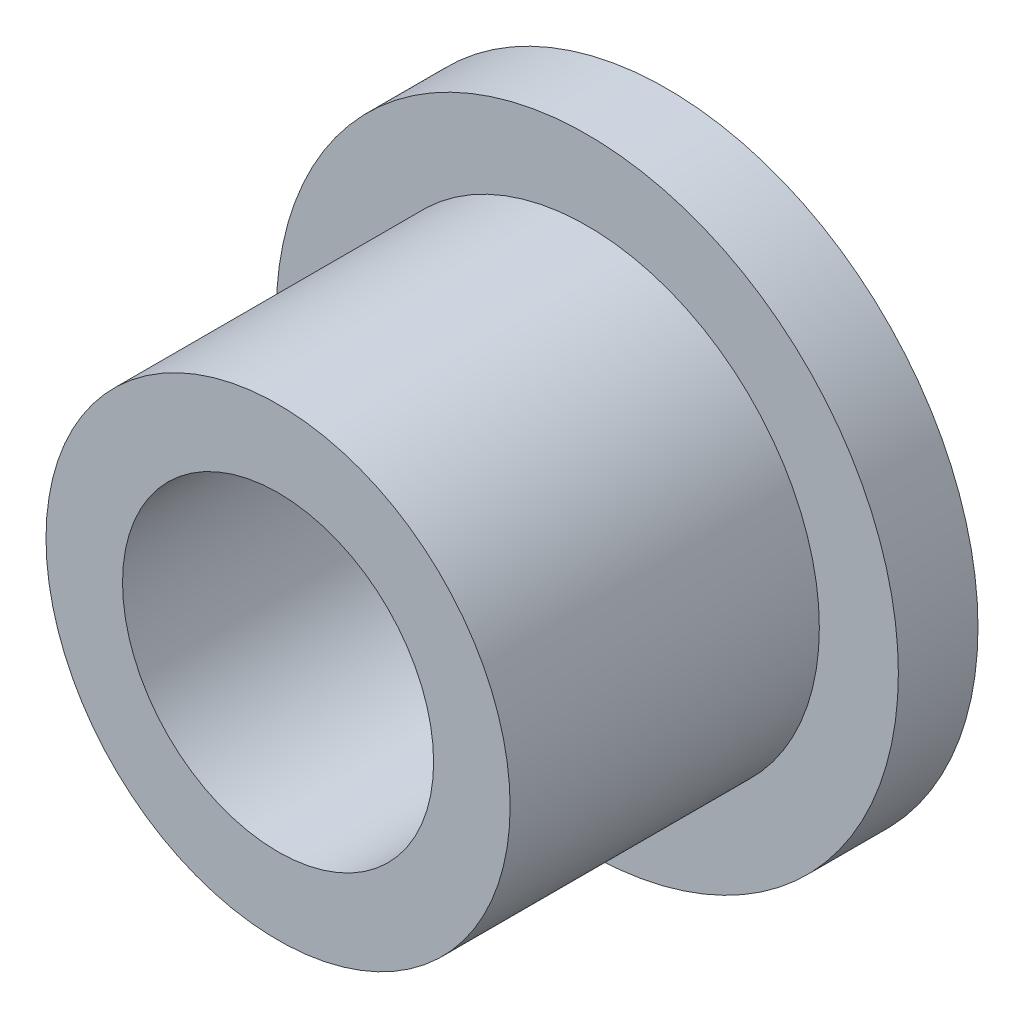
ISO-10303-21;
HEADER;
FILE_DESCRIPTION(('STEP AP214'),'2;1');
FILE_NAME('part.step','',(''),(''),'','','');
FILE_SCHEMA(('AUTOMOTIVE_DESIGN { 1 0 10303 214 1 1 1 1 }'));
ENDSEC;
DATA;
#1=APPLICATION_CONTEXT('core data for automotive mechanical design processes');
#2=APPLICATION_PROTOCOL_DEFINITION('international standard','automotive_design',2000,#1);
#3=PRODUCT_CONTEXT('',#1,'mechanical');
#4=PRODUCT('Part','Part','',(#3));
#5=PRODUCT_RELATED_PRODUCT_CATEGORY('part','',(#4));
#6=PRODUCT_DEFINITION_FORMATION('','',#4);
#7=PRODUCT_DEFINITION_CONTEXT('part definition',#1,'design');
#8=PRODUCT_DEFINITION('design','',#6,#7);
#9=PRODUCT_DEFINITION_SHAPE('','',#8);
#10=(LENGTH_UNIT() NAMED_UNIT(*) SI_UNIT(.MILLI.,.METRE.));
#11=(NAMED_UNIT(*) PLANE_ANGLE_UNIT() SI_UNIT($,.RADIAN.));
#12=(NAMED_UNIT(*) SI_UNIT($,.STERADIAN.) SOLID_ANGLE_UNIT());
#13=UNCERTAINTY_MEASURE_WITH_UNIT(LENGTH_MEASURE(1.E-05),#10,'distance_accuracy_value','');
#14=(GEOMETRIC_REPRESENTATION_CONTEXT(3) GLOBAL_UNCERTAINTY_ASSIGNED_CONTEXT((#13)) GLOBAL_UNIT_ASSIGNED_CONTEXT((#10,
#11,#12)) REPRESENTATION_CONTEXT('',''));
#15=CARTESIAN_POINT('',(0.,0.,0.));
#16=DIRECTION('',(0.,0.,1.));
#17=DIRECTION('',(1.,0.,0.));
#18=AXIS2_PLACEMENT_3D('',#15,#16,#17);
#19=CARTESIAN_POINT('',(0.,0.,7.9375));
#20=DIRECTION('',(0.,0.,-1.));
#21=DIRECTION('',(-1.,0.,0.));
#22=AXIS2_PLACEMENT_3D('',#19,#20,#21);
#23=CYLINDRICAL_SURFACE('',#22,4.7371);
#24=CARTESIAN_POINT('',(0.,0.,7.9375));
#25=DIRECTION('',(0.,0.,1.));
#26=DIRECTION('',(1.,0.,0.));
#27=AXIS2_PLACEMENT_3D('',#24,#25,#26);
#28=CIRCLE('',#27,4.7371);
#29=CARTESIAN_POINT('',(4.7371,0.,7.9375));
#30=VERTEX_POINT('',#29);
#31=EDGE_CURVE('E41',#30,#30,#28,.T.);
#32=ORIENTED_EDGE('',*,*,#31,.F.);
#33=EDGE_LOOP('',(#32));
#34=FACE_BOUND('',#33,.T.);
#35=CARTESIAN_POINT('',(0.,0.,1.6256));
#36=DIRECTION('',(0.,0.,-1.));
#37=DIRECTION('',(-1.,0.,0.));
#38=AXIS2_PLACEMENT_3D('',#35,#36,#37);
#39=CIRCLE('',#38,4.7371);
#40=CARTESIAN_POINT('',(-4.7371,0.,1.6256));
#41=VERTEX_POINT('',#40);
#42=EDGE_CURVE('E10',#41,#41,#39,.T.);
#43=ORIENTED_EDGE('',*,*,#42,.F.);
#44=EDGE_LOOP('',(#43));
#45=FACE_BOUND('',#44,.T.);
#46=ADVANCED_FACE('F35',(#34,#45),#23,.T.);
#47=CARTESIAN_POINT('',(0.,0.,7.9375));
#48=DIRECTION('',(0.,0.,1.));
#49=DIRECTION('',(1.,0.,0.));
#50=AXIS2_PLACEMENT_3D('',#47,#48,#49);
#51=PLANE('',#50);
#52=CARTESIAN_POINT('',(0.,0.,7.9375));
#53=DIRECTION('',(0.,0.,-1.));
#54=DIRECTION('',(-1.,0.,0.));
#55=AXIS2_PLACEMENT_3D('',#52,#53,#54);
#56=CIRCLE('',#55,3.175);
#57=CARTESIAN_POINT('',(-3.175,0.,7.9375));
#58=VERTEX_POINT('',#57);
#59=EDGE_CURVE('E45',#58,#58,#56,.T.);
#60=ORIENTED_EDGE('',*,*,#59,.T.);
#61=EDGE_LOOP('',(#60));
#62=FACE_BOUND('',#61,.T.);
#63=ORIENTED_EDGE('',*,*,#31,.T.);
#64=EDGE_LOOP('',(#63));
#65=FACE_BOUND('',#64,.T.);
#66=ADVANCED_FACE('F73',(#62,#65),#51,.T.);
#67=CARTESIAN_POINT('',(0.,0.,0.));
#68=DIRECTION('',(0.,0.,1.));
#69=DIRECTION('',(1.,0.,0.));
#70=AXIS2_PLACEMENT_3D('',#67,#68,#69);
#71=PLANE('',#70);
#72=CARTESIAN_POINT('',(0.,0.,0.));
#73=DIRECTION('',(0.,0.,-1.));
#74=DIRECTION('',(-1.,0.,0.));
#75=AXIS2_PLACEMENT_3D('',#72,#73,#74);
#76=CIRCLE('',#75,3.175);
#77=CARTESIAN_POINT('',(-3.175,0.,0.));
#78=VERTEX_POINT('',#77);
#79=EDGE_CURVE('E49',#78,#78,#76,.T.);
#80=ORIENTED_EDGE('',*,*,#79,.F.);
#81=EDGE_LOOP('',(#80));
#82=FACE_BOUND('',#81,.T.);
#83=CARTESIAN_POINT('',(0.,0.,0.));
#84=DIRECTION('',(0.,0.,-1.));
#85=DIRECTION('',(-1.,0.,0.));
#86=AXIS2_PLACEMENT_3D('',#83,#84,#85);
#87=CIRCLE('',#86,6.35);
#88=CARTESIAN_POINT('',(-6.35,0.,0.));
#89=VERTEX_POINT('',#88);
#90=EDGE_CURVE('E55',#89,#89,#87,.T.);
#91=ORIENTED_EDGE('',*,*,#90,.T.);
#92=EDGE_LOOP('',(#91));
#93=FACE_BOUND('',#92,.T.);
#94=ADVANCED_FACE('F78',(#82,#93),#71,.F.);
#95=CARTESIAN_POINT('',(0.,0.,7.9375));
#96=DIRECTION('',(0.,0.,-1.));
#97=DIRECTION('',(-1.,0.,0.));
#98=AXIS2_PLACEMENT_3D('',#95,#96,#97);
#99=CYLINDRICAL_SURFACE('',#98,3.175);
#100=ORIENTED_EDGE('',*,*,#59,.F.);
#101=EDGE_LOOP('',(#100));
#102=FACE_BOUND('',#101,.T.);
#103=ORIENTED_EDGE('',*,*,#79,.T.);
#104=EDGE_LOOP('',(#103));
#105=FACE_BOUND('',#104,.T.);
#106=ADVANCED_FACE('F70',(#102,#105),#99,.F.);
#107=CARTESIAN_POINT('',(0.,0.,1.6256));
#108=DIRECTION('',(0.,0.,-1.));
#109=DIRECTION('',(-1.,0.,0.));
#110=AXIS2_PLACEMENT_3D('',#107,#108,#109);
#111=CYLINDRICAL_SURFACE('',#110,6.35);
#112=CARTESIAN_POINT('',(0.,0.,1.6256));
#113=DIRECTION('',(0.,0.,-1.));
#114=DIRECTION('',(-1.,0.,0.));
#115=AXIS2_PLACEMENT_3D('',#112,#113,#114);
#116=CIRCLE('',#115,6.35);
#117=CARTESIAN_POINT('',(-6.35,0.,1.6256));
#118=VERTEX_POINT('',#117);
#119=EDGE_CURVE('E53',#118,#118,#116,.T.);
#120=ORIENTED_EDGE('',*,*,#119,.T.);
#121=EDGE_LOOP('',(#120));
#122=FACE_BOUND('',#121,.T.);
#123=ORIENTED_EDGE('',*,*,#90,.F.);
#124=EDGE_LOOP('',(#123));
#125=FACE_BOUND('',#124,.T.);
#126=ADVANCED_FACE('F61',(#122,#125),#111,.T.);
#127=CARTESIAN_POINT('',(0.,0.,1.6256));
#128=DIRECTION('',(0.,0.,-1.));
#129=DIRECTION('',(-1.,0.,0.));
#130=AXIS2_PLACEMENT_3D('',#127,#128,#129);
#131=PLANE('',#130);
#132=ORIENTED_EDGE('',*,*,#42,.T.);
#133=EDGE_LOOP('',(#132));
#134=FACE_BOUND('',#133,.T.);
#135=ORIENTED_EDGE('',*,*,#119,.F.);
#136=EDGE_LOOP('',(#135));
#137=FACE_BOUND('',#136,.T.);
#138=ADVANCED_FACE('F64',(#134,#137),#131,.F.);
#139=CLOSED_SHELL('',(#46,#66,#94,#106,#126,#138));
#140=MANIFOLD_SOLID_BREP('B2',#139);
#141=ADVANCED_BREP_SHAPE_REPRESENTATION('',(#18,#140),#14);
#142=SHAPE_DEFINITION_REPRESENTATION(#9,#141);
ENDSEC;
END-ISO-10303-21;
